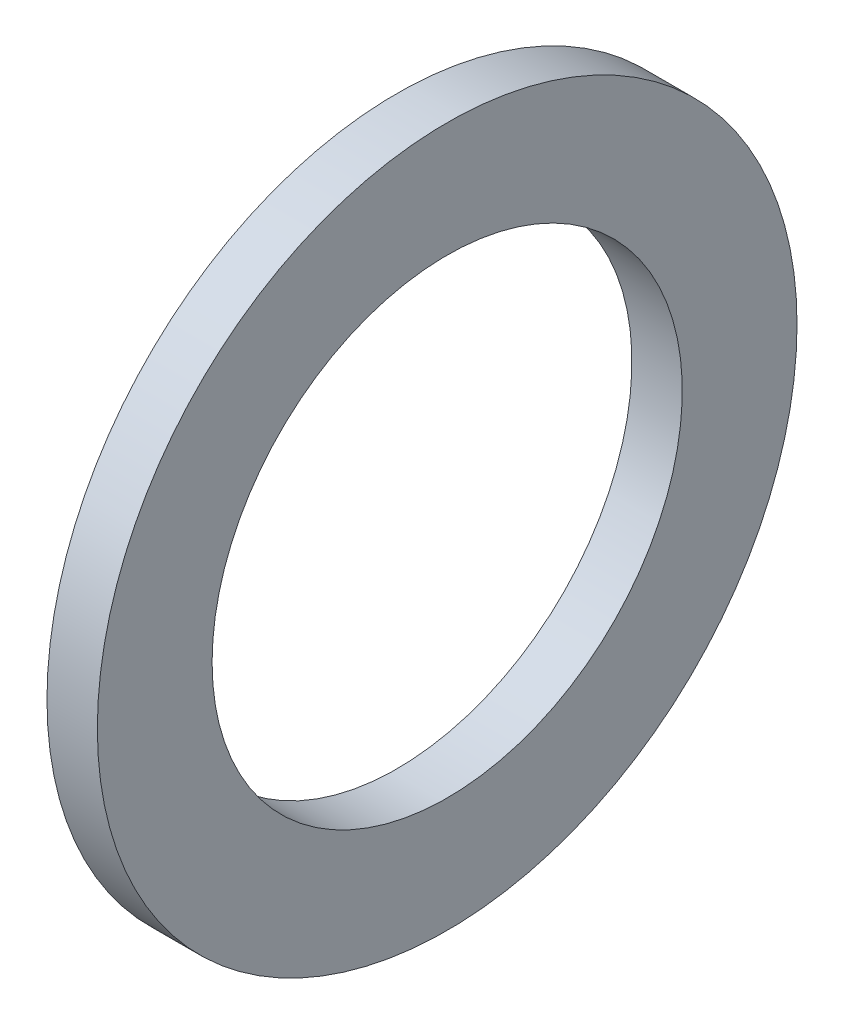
ISO-10303-21;
HEADER;
FILE_DESCRIPTION(('STEP AP214'),'2;1');
FILE_NAME('part.step','',(''),(''),'','','');
FILE_SCHEMA(('AUTOMOTIVE_DESIGN { 1 0 10303 214 1 1 1 1 }'));
ENDSEC;
DATA;
#1=APPLICATION_CONTEXT('core data for automotive mechanical design processes');
#2=APPLICATION_PROTOCOL_DEFINITION('international standard','automotive_design',2000,#1);
#3=PRODUCT_CONTEXT('',#1,'mechanical');
#4=PRODUCT('Part','Part','',(#3));
#5=PRODUCT_RELATED_PRODUCT_CATEGORY('part','',(#4));
#6=PRODUCT_DEFINITION_FORMATION('','',#4);
#7=PRODUCT_DEFINITION_CONTEXT('part definition',#1,'design');
#8=PRODUCT_DEFINITION('design','',#6,#7);
#9=PRODUCT_DEFINITION_SHAPE('','',#8);
#10=(LENGTH_UNIT() NAMED_UNIT(*) SI_UNIT(.MILLI.,.METRE.));
#11=(NAMED_UNIT(*) PLANE_ANGLE_UNIT() SI_UNIT($,.RADIAN.));
#12=(NAMED_UNIT(*) SI_UNIT($,.STERADIAN.) SOLID_ANGLE_UNIT());
#13=UNCERTAINTY_MEASURE_WITH_UNIT(LENGTH_MEASURE(1.E-05),#10,'distance_accuracy_value','');
#14=(GEOMETRIC_REPRESENTATION_CONTEXT(3) GLOBAL_UNCERTAINTY_ASSIGNED_CONTEXT((#13)) GLOBAL_UNIT_ASSIGNED_CONTEXT((#10,
#11,#12)) REPRESENTATION_CONTEXT('',''));
#15=CARTESIAN_POINT('',(0.,0.,0.));
#16=DIRECTION('',(0.,0.,1.));
#17=DIRECTION('',(1.,0.,0.));
#18=AXIS2_PLACEMENT_3D('',#15,#16,#17);
#19=CARTESIAN_POINT('',(-34.9249999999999,0.,0.));
#20=DIRECTION('',(-1.,0.,0.));
#21=DIRECTION('',(0.,0.,1.));
#22=AXIS2_PLACEMENT_3D('',#19,#20,#21);
#23=CYLINDRICAL_SURFACE('',#22,84.);
#24=CARTESIAN_POINT('',(0.,0.,0.));
#25=DIRECTION('',(-1.,0.,0.));
#26=DIRECTION('',(0.,0.,1.));
#27=AXIS2_PLACEMENT_3D('',#24,#25,#26);
#28=CIRCLE('',#27,84.);
#29=CARTESIAN_POINT('',(0.,0.,84.));
#30=VERTEX_POINT('',#29);
#31=EDGE_CURVE('E10',#30,#30,#28,.T.);
#32=ORIENTED_EDGE('',*,*,#31,.F.);
#33=EDGE_LOOP('',(#32));
#34=FACE_BOUND('',#33,.T.);
#35=CARTESIAN_POINT('',(-18.,0.,0.));
#36=DIRECTION('',(-1.,0.,0.));
#37=DIRECTION('',(0.,0.,1.));
#38=AXIS2_PLACEMENT_3D('',#35,#36,#37);
#39=CIRCLE('',#38,84.);
#40=CARTESIAN_POINT('',(-18.,0.,84.));
#41=VERTEX_POINT('',#40);
#42=EDGE_CURVE('E51',#41,#41,#39,.T.);
#43=ORIENTED_EDGE('',*,*,#42,.T.);
#44=EDGE_LOOP('',(#43));
#45=FACE_BOUND('',#44,.T.);
#46=ADVANCED_FACE('F40',(#34,#45),#23,.F.);
#47=CARTESIAN_POINT('',(0.,84.,0.));
#48=DIRECTION('',(-1.,0.,0.));
#49=DIRECTION('',(0.,0.,1.));
#50=AXIS2_PLACEMENT_3D('',#47,#48,#49);
#51=PLANE('',#50);
#52=CARTESIAN_POINT('',(0.,0.,0.));
#53=DIRECTION('',(-1.,0.,0.));
#54=DIRECTION('',(0.,0.,1.));
#55=AXIS2_PLACEMENT_3D('',#52,#53,#54);
#56=CIRCLE('',#55,125.);
#57=CARTESIAN_POINT('',(0.,0.,125.));
#58=VERTEX_POINT('',#57);
#59=EDGE_CURVE('E43',#58,#58,#56,.T.);
#60=ORIENTED_EDGE('',*,*,#59,.F.);
#61=EDGE_LOOP('',(#60));
#62=FACE_BOUND('',#61,.T.);
#63=ORIENTED_EDGE('',*,*,#31,.T.);
#64=EDGE_LOOP('',(#63));
#65=FACE_BOUND('',#64,.T.);
#66=ADVANCED_FACE('F68',(#62,#65),#51,.F.);
#67=CARTESIAN_POINT('',(-34.9249999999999,0.,0.));
#68=DIRECTION('',(-1.,0.,0.));
#69=DIRECTION('',(0.,0.,1.));
#70=AXIS2_PLACEMENT_3D('',#67,#68,#69);
#71=CYLINDRICAL_SURFACE('',#70,125.);
#72=CARTESIAN_POINT('',(-18.,0.,0.));
#73=DIRECTION('',(-1.,0.,0.));
#74=DIRECTION('',(0.,0.,1.));
#75=AXIS2_PLACEMENT_3D('',#72,#73,#74);
#76=CIRCLE('',#75,125.);
#77=CARTESIAN_POINT('',(-18.,0.,125.));
#78=VERTEX_POINT('',#77);
#79=EDGE_CURVE('E50',#78,#78,#76,.T.);
#80=ORIENTED_EDGE('',*,*,#79,.F.);
#81=EDGE_LOOP('',(#80));
#82=FACE_BOUND('',#81,.T.);
#83=ORIENTED_EDGE('',*,*,#59,.T.);
#84=EDGE_LOOP('',(#83));
#85=FACE_BOUND('',#84,.T.);
#86=ADVANCED_FACE('F62',(#82,#85),#71,.T.);
#87=CARTESIAN_POINT('',(-18.,125.,0.));
#88=DIRECTION('',(1.,0.,0.));
#89=DIRECTION('',(0.,0.,-1.));
#90=AXIS2_PLACEMENT_3D('',#87,#88,#89);
#91=PLANE('',#90);
#92=ORIENTED_EDGE('',*,*,#42,.F.);
#93=EDGE_LOOP('',(#92));
#94=FACE_BOUND('',#93,.T.);
#95=ORIENTED_EDGE('',*,*,#79,.T.);
#96=EDGE_LOOP('',(#95));
#97=FACE_BOUND('',#96,.T.);
#98=ADVANCED_FACE('F59',(#94,#97),#91,.F.);
#99=CLOSED_SHELL('',(#46,#66,#86,#98));
#100=MANIFOLD_SOLID_BREP('B2',#99);
#101=ADVANCED_BREP_SHAPE_REPRESENTATION('',(#18,#100),#14);
#102=SHAPE_DEFINITION_REPRESENTATION(#9,#101);
ENDSEC;
END-ISO-10303-21;
